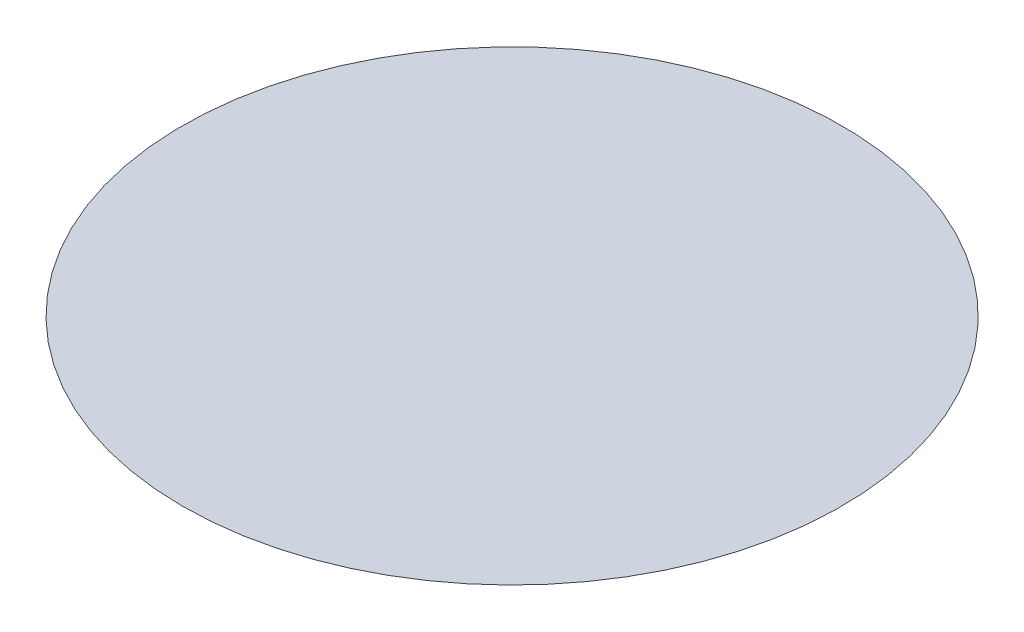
ISO-10303-21;
HEADER;
FILE_DESCRIPTION(('STEP AP214'),'2;1');
FILE_NAME('part.step','',(''),(''),'','','');
FILE_SCHEMA(('AUTOMOTIVE_DESIGN { 1 0 10303 214 1 1 1 1 }'));
ENDSEC;
DATA;
#1=APPLICATION_CONTEXT('core data for automotive mechanical design processes');
#2=APPLICATION_PROTOCOL_DEFINITION('international standard','automotive_design',2000,#1);
#3=PRODUCT_CONTEXT('',#1,'mechanical');
#4=PRODUCT('Part','Part','',(#3));
#5=PRODUCT_RELATED_PRODUCT_CATEGORY('part','',(#4));
#6=PRODUCT_DEFINITION_FORMATION('','',#4);
#7=PRODUCT_DEFINITION_CONTEXT('part definition',#1,'design');
#8=PRODUCT_DEFINITION('design','',#6,#7);
#9=PRODUCT_DEFINITION_SHAPE('','',#8);
#10=(LENGTH_UNIT() NAMED_UNIT(*) SI_UNIT(.MILLI.,.METRE.));
#11=(NAMED_UNIT(*) PLANE_ANGLE_UNIT() SI_UNIT($,.RADIAN.));
#12=(NAMED_UNIT(*) SI_UNIT($,.STERADIAN.) SOLID_ANGLE_UNIT());
#13=UNCERTAINTY_MEASURE_WITH_UNIT(LENGTH_MEASURE(1.E-05),#10,'distance_accuracy_value','');
#14=(GEOMETRIC_REPRESENTATION_CONTEXT(3) GLOBAL_UNCERTAINTY_ASSIGNED_CONTEXT((#13)) GLOBAL_UNIT_ASSIGNED_CONTEXT((#10,
#11,#12)) REPRESENTATION_CONTEXT('',''));
#15=CARTESIAN_POINT('',(0.,0.,0.));
#16=DIRECTION('',(0.,0.,1.));
#17=DIRECTION('',(1.,0.,0.));
#18=AXIS2_PLACEMENT_3D('',#15,#16,#17);
#19=CARTESIAN_POINT('',(0.,25.,0.));
#20=DIRECTION('',(0.,1.,0.));
#21=DIRECTION('',(-1.,0.,0.));
#22=AXIS2_PLACEMENT_3D('',#19,#20,#21);
#23=SPHERICAL_SURFACE('',#22,30.);
#24=CARTESIAN_POINT('',(0.,-1.25,0.));
#25=DIRECTION('',(0.,1.,0.));
#26=DIRECTION('',(0.,0.,1.));
#27=AXIS2_PLACEMENT_3D('',#24,#25,#26);
#28=CIRCLE('',#27,14.5236875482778);
#29=CARTESIAN_POINT('',(0.,-1.25,14.5236875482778));
#30=VERTEX_POINT('',#29);
#31=EDGE_CURVE('E10',#30,#30,#28,.F.);
#32=ORIENTED_EDGE('',*,*,#31,.T.);
#33=EDGE_LOOP('',(#32));
#34=FACE_BOUND('',#33,.T.);
#35=ADVANCED_FACE('F34',(#34),#23,.T.);
#36=CARTESIAN_POINT('',(0.,-10.,0.));
#37=DIRECTION('',(0.,1.,0.));
#38=DIRECTION('',(0.,0.,1.));
#39=AXIS2_PLACEMENT_3D('',#36,#37,#38);
#40=TOROIDAL_SURFACE('',#39,19.3649167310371,10.);
#41=CARTESIAN_POINT('',(0.,0.,0.));
#42=DIRECTION('',(0.,1.,0.));
#43=DIRECTION('',(0.,0.,1.));
#44=AXIS2_PLACEMENT_3D('',#41,#42,#43);
#45=CIRCLE('',#44,19.3649167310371);
#46=CARTESIAN_POINT('',(0.,0.,19.3649167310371));
#47=VERTEX_POINT('',#46);
#48=EDGE_CURVE('E40',#47,#47,#45,.F.);
#49=ORIENTED_EDGE('',*,*,#48,.T.);
#50=EDGE_LOOP('',(#49));
#51=FACE_BOUND('',#50,.T.);
#52=ORIENTED_EDGE('',*,*,#31,.F.);
#53=EDGE_LOOP('',(#52));
#54=FACE_BOUND('',#53,.T.);
#55=ADVANCED_FACE('F46',(#51,#54),#40,.F.);
#56=CARTESIAN_POINT('',(-20.6503427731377,0.,25.));
#57=DIRECTION('',(0.,-1.,0.));
#58=DIRECTION('',(0.,0.,-1.));
#59=AXIS2_PLACEMENT_3D('',#56,#57,#58);
#60=PLANE('',#59);
#61=ORIENTED_EDGE('',*,*,#48,.F.);
#62=EDGE_LOOP('',(#61));
#63=FACE_BOUND('',#62,.T.);
#64=ADVANCED_FACE('F49',(#63),#60,.F.);
#65=CLOSED_SHELL('',(#35,#55,#64));
#66=MANIFOLD_SOLID_BREP('B2',#65);
#67=ADVANCED_BREP_SHAPE_REPRESENTATION('',(#18,#66),#14);
#68=SHAPE_DEFINITION_REPRESENTATION(#9,#67);
ENDSEC;
END-ISO-10303-21;
